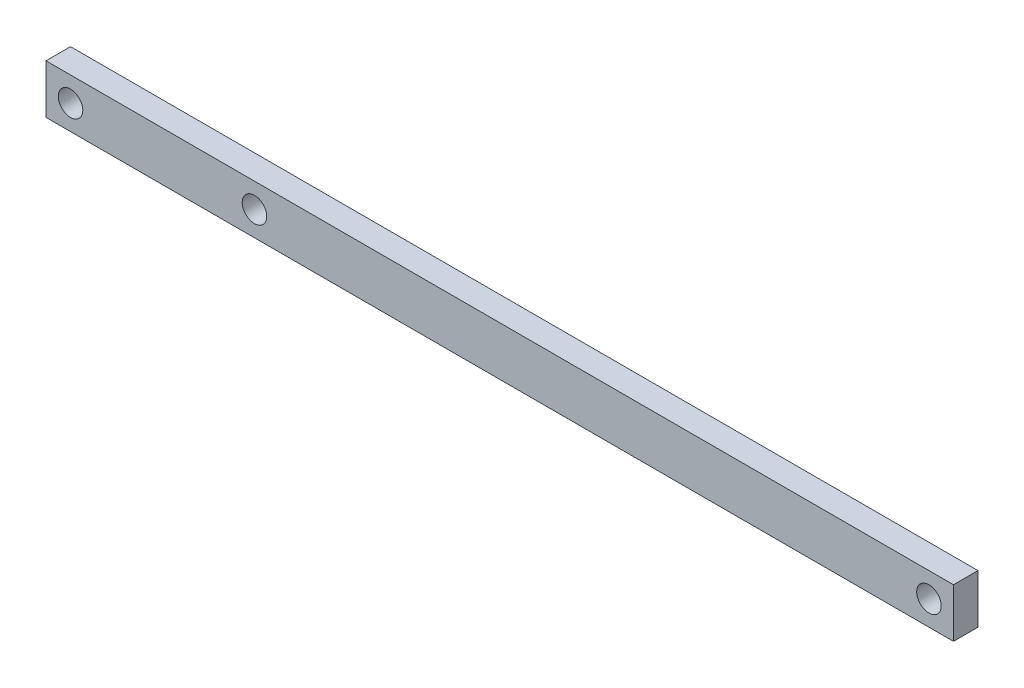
ISO-10303-21;
HEADER;
FILE_DESCRIPTION(('STEP AP214'),'2;1');
FILE_NAME('part.step','',(''),(''),'','','');
FILE_SCHEMA(('AUTOMOTIVE_DESIGN { 1 0 10303 214 1 1 1 1 }'));
ENDSEC;
DATA;
#1=APPLICATION_CONTEXT('core data for automotive mechanical design processes');
#2=APPLICATION_PROTOCOL_DEFINITION('international standard','automotive_design',2000,#1);
#3=PRODUCT_CONTEXT('',#1,'mechanical');
#4=PRODUCT('Part','Part','',(#3));
#5=PRODUCT_RELATED_PRODUCT_CATEGORY('part','',(#4));
#6=PRODUCT_DEFINITION_FORMATION('','',#4);
#7=PRODUCT_DEFINITION_CONTEXT('part definition',#1,'design');
#8=PRODUCT_DEFINITION('design','',#6,#7);
#9=PRODUCT_DEFINITION_SHAPE('','',#8);
#10=(LENGTH_UNIT() NAMED_UNIT(*) SI_UNIT(.MILLI.,.METRE.));
#11=(NAMED_UNIT(*) PLANE_ANGLE_UNIT() SI_UNIT($,.RADIAN.));
#12=(NAMED_UNIT(*) SI_UNIT($,.STERADIAN.) SOLID_ANGLE_UNIT());
#13=UNCERTAINTY_MEASURE_WITH_UNIT(LENGTH_MEASURE(1.E-05),#10,'distance_accuracy_value','');
#14=(GEOMETRIC_REPRESENTATION_CONTEXT(3) GLOBAL_UNCERTAINTY_ASSIGNED_CONTEXT((#13)) GLOBAL_UNIT_ASSIGNED_CONTEXT((#10,
#11,#12)) REPRESENTATION_CONTEXT('',''));
#15=CARTESIAN_POINT('',(0.,0.,0.));
#16=DIRECTION('',(0.,0.,1.));
#17=DIRECTION('',(1.,0.,0.));
#18=AXIS2_PLACEMENT_3D('',#15,#16,#17);
#19=CARTESIAN_POINT('',(-350.,-20.,-10.));
#20=DIRECTION('',(0.,-1.,0.));
#21=DIRECTION('',(0.,0.,-1.));
#22=AXIS2_PLACEMENT_3D('',#19,#20,#21);
#23=PLANE('',#22);
#24=DIRECTION('',(1.,0.,0.));
#25=VECTOR('',#24,1.);
#26=CARTESIAN_POINT('',(-350.,-20.,-10.));
#27=LINE('',#26,#25);
#28=CARTESIAN_POINT('',(-370.,-20.,-10.));
#29=VERTEX_POINT('',#28);
#30=CARTESIAN_POINT('',(370.,-20.,-10.));
#31=VERTEX_POINT('',#30);
#32=EDGE_CURVE('E11',#29,#31,#27,.T.);
#33=ORIENTED_EDGE('',*,*,#32,.T.);
#34=DIRECTION('',(0.,0.,-1.));
#35=VECTOR('',#34,1.);
#36=CARTESIAN_POINT('',(370.,-20.,10.));
#37=LINE('',#36,#35);
#38=CARTESIAN_POINT('',(370.,-20.,10.));
#39=VERTEX_POINT('',#38);
#40=EDGE_CURVE('E102',#39,#31,#37,.T.);
#41=ORIENTED_EDGE('',*,*,#40,.F.);
#42=DIRECTION('',(1.,0.,0.));
#43=VECTOR('',#42,1.);
#44=CARTESIAN_POINT('',(-350.,-20.,10.));
#45=LINE('',#44,#43);
#46=CARTESIAN_POINT('',(-370.,-20.,10.));
#47=VERTEX_POINT('',#46);
#48=EDGE_CURVE('E81',#47,#39,#45,.T.);
#49=ORIENTED_EDGE('',*,*,#48,.F.);
#50=DIRECTION('',(0.,0.,1.));
#51=VECTOR('',#50,1.);
#52=CARTESIAN_POINT('',(-370.,-20.,-10.));
#53=LINE('',#52,#51);
#54=EDGE_CURVE('E80',#29,#47,#53,.T.);
#55=ORIENTED_EDGE('',*,*,#54,.F.);
#56=EDGE_LOOP('',(#33,#41,#49,#55));
#57=FACE_BOUND('',#56,.T.);
#58=ADVANCED_FACE('F33',(#57),#23,.T.);
#59=CARTESIAN_POINT('',(-350.,20.,-10.));
#60=DIRECTION('',(0.,1.,0.));
#61=DIRECTION('',(0.,0.,1.));
#62=AXIS2_PLACEMENT_3D('',#59,#60,#61);
#63=PLANE('',#62);
#64=DIRECTION('',(-1.,0.,0.));
#65=VECTOR('',#64,1.);
#66=CARTESIAN_POINT('',(-350.,20.,-10.));
#67=LINE('',#66,#65);
#68=CARTESIAN_POINT('',(370.,20.,-10.));
#69=VERTEX_POINT('',#68);
#70=CARTESIAN_POINT('',(-370.,20.,-10.));
#71=VERTEX_POINT('',#70);
#72=EDGE_CURVE('E41',#69,#71,#67,.T.);
#73=ORIENTED_EDGE('',*,*,#72,.T.);
#74=DIRECTION('',(0.,0.,-1.));
#75=VECTOR('',#74,1.);
#76=CARTESIAN_POINT('',(-370.,20.,-10.));
#77=LINE('',#76,#75);
#78=CARTESIAN_POINT('',(-370.,20.,10.));
#79=VERTEX_POINT('',#78);
#80=EDGE_CURVE('E89',#79,#71,#77,.T.);
#81=ORIENTED_EDGE('',*,*,#80,.F.);
#82=DIRECTION('',(-1.,0.,0.));
#83=VECTOR('',#82,1.);
#84=CARTESIAN_POINT('',(-350.,20.,10.));
#85=LINE('',#84,#83);
#86=CARTESIAN_POINT('',(370.,20.,10.));
#87=VERTEX_POINT('',#86);
#88=EDGE_CURVE('E48',#87,#79,#85,.T.);
#89=ORIENTED_EDGE('',*,*,#88,.F.);
#90=DIRECTION('',(0.,0.,1.));
#91=VECTOR('',#90,1.);
#92=CARTESIAN_POINT('',(370.,20.,10.));
#93=LINE('',#92,#91);
#94=EDGE_CURVE('E105',#69,#87,#93,.T.);
#95=ORIENTED_EDGE('',*,*,#94,.F.);
#96=EDGE_LOOP('',(#73,#81,#89,#95));
#97=FACE_BOUND('',#96,.T.);
#98=ADVANCED_FACE('F35',(#97),#63,.T.);
#99=CARTESIAN_POINT('',(0.,0.,-10.));
#100=DIRECTION('',(0.,0.,1.));
#101=DIRECTION('',(1.,0.,0.));
#102=AXIS2_PLACEMENT_3D('',#99,#100,#101);
#103=PLANE('',#102);
#104=CARTESIAN_POINT('',(-200.,0.,-10.));
#105=DIRECTION('',(0.,0.,1.));
#106=DIRECTION('',(1.,0.,0.));
#107=AXIS2_PLACEMENT_3D('',#104,#105,#106);
#108=CIRCLE('',#107,10.);
#109=CARTESIAN_POINT('',(-190.,0.,-10.));
#110=VERTEX_POINT('',#109);
#111=EDGE_CURVE('E229',#110,#110,#108,.F.);
#112=ORIENTED_EDGE('',*,*,#111,.F.);
#113=EDGE_LOOP('',(#112));
#114=FACE_BOUND('',#113,.T.);
#115=CARTESIAN_POINT('',(-350.,0.,-10.));
#116=DIRECTION('',(0.,0.,1.));
#117=DIRECTION('',(1.,0.,0.));
#118=AXIS2_PLACEMENT_3D('',#115,#116,#117);
#119=CIRCLE('',#118,9.99999999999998);
#120=CARTESIAN_POINT('',(-340.,0.,-10.));
#121=VERTEX_POINT('',#120);
#122=EDGE_CURVE('E222',#121,#121,#119,.F.);
#123=ORIENTED_EDGE('',*,*,#122,.F.);
#124=EDGE_LOOP('',(#123));
#125=FACE_BOUND('',#124,.T.);
#126=CARTESIAN_POINT('',(350.,0.,-10.));
#127=DIRECTION('',(0.,0.,1.));
#128=DIRECTION('',(1.,0.,0.));
#129=AXIS2_PLACEMENT_3D('',#126,#127,#128);
#130=CIRCLE('',#129,9.99999999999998);
#131=CARTESIAN_POINT('',(360.,0.,-10.));
#132=VERTEX_POINT('',#131);
#133=EDGE_CURVE('E90',#132,#132,#130,.F.);
#134=ORIENTED_EDGE('',*,*,#133,.F.);
#135=EDGE_LOOP('',(#134));
#136=FACE_BOUND('',#135,.T.);
#137=ORIENTED_EDGE('',*,*,#72,.F.);
#138=DIRECTION('',(0.,1.,0.));
#139=VECTOR('',#138,1.);
#140=CARTESIAN_POINT('',(370.,20.,-10.));
#141=LINE('',#140,#139);
#142=EDGE_CURVE('E75',#31,#69,#141,.T.);
#143=ORIENTED_EDGE('',*,*,#142,.F.);
#144=ORIENTED_EDGE('',*,*,#32,.F.);
#145=DIRECTION('',(0.,-1.,0.));
#146=VECTOR('',#145,1.);
#147=CARTESIAN_POINT('',(-370.,20.,-10.));
#148=LINE('',#147,#146);
#149=EDGE_CURVE('E74',#71,#29,#148,.T.);
#150=ORIENTED_EDGE('',*,*,#149,.F.);
#151=EDGE_LOOP('',(#137,#143,#144,#150));
#152=FACE_BOUND('',#151,.T.);
#153=ADVANCED_FACE('F72',(#114,#125,#136,#152),#103,.F.);
#154=CARTESIAN_POINT('',(0.,0.,10.));
#155=DIRECTION('',(0.,0.,1.));
#156=DIRECTION('',(1.,0.,0.));
#157=AXIS2_PLACEMENT_3D('',#154,#155,#156);
#158=PLANE('',#157);
#159=CARTESIAN_POINT('',(-200.,0.,10.));
#160=DIRECTION('',(0.,0.,1.));
#161=DIRECTION('',(1.,0.,0.));
#162=AXIS2_PLACEMENT_3D('',#159,#160,#161);
#163=CIRCLE('',#162,10.);
#164=CARTESIAN_POINT('',(-190.,0.,10.));
#165=VERTEX_POINT('',#164);
#166=EDGE_CURVE('E232',#165,#165,#163,.T.);
#167=ORIENTED_EDGE('',*,*,#166,.F.);
#168=EDGE_LOOP('',(#167));
#169=FACE_BOUND('',#168,.T.);
#170=CARTESIAN_POINT('',(-350.,0.,10.));
#171=DIRECTION('',(0.,0.,1.));
#172=DIRECTION('',(1.,0.,0.));
#173=AXIS2_PLACEMENT_3D('',#170,#171,#172);
#174=CIRCLE('',#173,9.99999999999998);
#175=CARTESIAN_POINT('',(-340.,0.,10.));
#176=VERTEX_POINT('',#175);
#177=EDGE_CURVE('E224',#176,#176,#174,.T.);
#178=ORIENTED_EDGE('',*,*,#177,.F.);
#179=EDGE_LOOP('',(#178));
#180=FACE_BOUND('',#179,.T.);
#181=CARTESIAN_POINT('',(350.,0.,10.));
#182=DIRECTION('',(0.,0.,1.));
#183=DIRECTION('',(1.,0.,0.));
#184=AXIS2_PLACEMENT_3D('',#181,#182,#183);
#185=CIRCLE('',#184,9.99999999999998);
#186=CARTESIAN_POINT('',(360.,0.,10.));
#187=VERTEX_POINT('',#186);
#188=EDGE_CURVE('E93',#187,#187,#185,.T.);
#189=ORIENTED_EDGE('',*,*,#188,.F.);
#190=EDGE_LOOP('',(#189));
#191=FACE_BOUND('',#190,.T.);
#192=ORIENTED_EDGE('',*,*,#48,.T.);
#193=DIRECTION('',(0.,-1.,0.));
#194=VECTOR('',#193,1.);
#195=CARTESIAN_POINT('',(370.,20.,10.));
#196=LINE('',#195,#194);
#197=EDGE_CURVE('E99',#87,#39,#196,.T.);
#198=ORIENTED_EDGE('',*,*,#197,.F.);
#199=ORIENTED_EDGE('',*,*,#88,.T.);
#200=DIRECTION('',(0.,1.,0.));
#201=VECTOR('',#200,1.);
#202=CARTESIAN_POINT('',(-370.,20.,10.));
#203=LINE('',#202,#201);
#204=EDGE_CURVE('E85',#47,#79,#203,.T.);
#205=ORIENTED_EDGE('',*,*,#204,.F.);
#206=EDGE_LOOP('',(#192,#198,#199,#205));
#207=FACE_BOUND('',#206,.T.);
#208=ADVANCED_FACE('F112',(#169,#180,#191,#207),#158,.T.);
#209=CARTESIAN_POINT('',(370.,0.,0.));
#210=DIRECTION('',(1.,0.,0.));
#211=DIRECTION('',(0.,0.,-1.));
#212=AXIS2_PLACEMENT_3D('',#209,#210,#211);
#213=PLANE('',#212);
#214=ORIENTED_EDGE('',*,*,#197,.T.);
#215=ORIENTED_EDGE('',*,*,#40,.T.);
#216=ORIENTED_EDGE('',*,*,#142,.T.);
#217=ORIENTED_EDGE('',*,*,#94,.T.);
#218=EDGE_LOOP('',(#214,#215,#216,#217));
#219=FACE_BOUND('',#218,.T.);
#220=ADVANCED_FACE('F110',(#219),#213,.T.);
#221=CARTESIAN_POINT('',(-370.,0.,0.));
#222=DIRECTION('',(-1.,0.,0.));
#223=DIRECTION('',(0.,0.,1.));
#224=AXIS2_PLACEMENT_3D('',#221,#222,#223);
#225=PLANE('',#224);
#226=ORIENTED_EDGE('',*,*,#149,.T.);
#227=ORIENTED_EDGE('',*,*,#54,.T.);
#228=ORIENTED_EDGE('',*,*,#204,.T.);
#229=ORIENTED_EDGE('',*,*,#80,.T.);
#230=EDGE_LOOP('',(#226,#227,#228,#229));
#231=FACE_BOUND('',#230,.T.);
#232=ADVANCED_FACE('F88',(#231),#225,.T.);
#233=CARTESIAN_POINT('',(350.,0.,-38.2842712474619));
#234=DIRECTION('',(0.,0.,1.));
#235=DIRECTION('',(1.,0.,0.));
#236=AXIS2_PLACEMENT_3D('',#233,#234,#235);
#237=CYLINDRICAL_SURFACE('',#236,9.99999999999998);
#238=ORIENTED_EDGE('',*,*,#133,.T.);
#239=EDGE_LOOP('',(#238));
#240=FACE_BOUND('',#239,.T.);
#241=ORIENTED_EDGE('',*,*,#188,.T.);
#242=EDGE_LOOP('',(#241));
#243=FACE_BOUND('',#242,.T.);
#244=ADVANCED_FACE('F165',(#240,#243),#237,.F.);
#245=CARTESIAN_POINT('',(-350.,0.,-38.2842712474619));
#246=DIRECTION('',(0.,0.,1.));
#247=DIRECTION('',(1.,0.,0.));
#248=AXIS2_PLACEMENT_3D('',#245,#246,#247);
#249=CYLINDRICAL_SURFACE('',#248,9.99999999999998);
#250=ORIENTED_EDGE('',*,*,#122,.T.);
#251=EDGE_LOOP('',(#250));
#252=FACE_BOUND('',#251,.T.);
#253=ORIENTED_EDGE('',*,*,#177,.T.);
#254=EDGE_LOOP('',(#253));
#255=FACE_BOUND('',#254,.T.);
#256=ADVANCED_FACE('F143',(#252,#255),#249,.F.);
#257=CARTESIAN_POINT('',(-200.,0.,-38.2842712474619));
#258=DIRECTION('',(0.,0.,1.));
#259=DIRECTION('',(1.,0.,0.));
#260=AXIS2_PLACEMENT_3D('',#257,#258,#259);
#261=CYLINDRICAL_SURFACE('',#260,10.);
#262=ORIENTED_EDGE('',*,*,#111,.T.);
#263=EDGE_LOOP('',(#262));
#264=FACE_BOUND('',#263,.T.);
#265=ORIENTED_EDGE('',*,*,#166,.T.);
#266=EDGE_LOOP('',(#265));
#267=FACE_BOUND('',#266,.T.);
#268=ADVANCED_FACE('F154',(#264,#267),#261,.F.);
#269=CLOSED_SHELL('',(#58,#98,#153,#208,#220,#232,#244,#256,#268));
#270=MANIFOLD_SOLID_BREP('B2',#269);
#271=ADVANCED_BREP_SHAPE_REPRESENTATION('',(#18,#270),#14);
#272=SHAPE_DEFINITION_REPRESENTATION(#9,#271);
ENDSEC;
END-ISO-10303-21;
